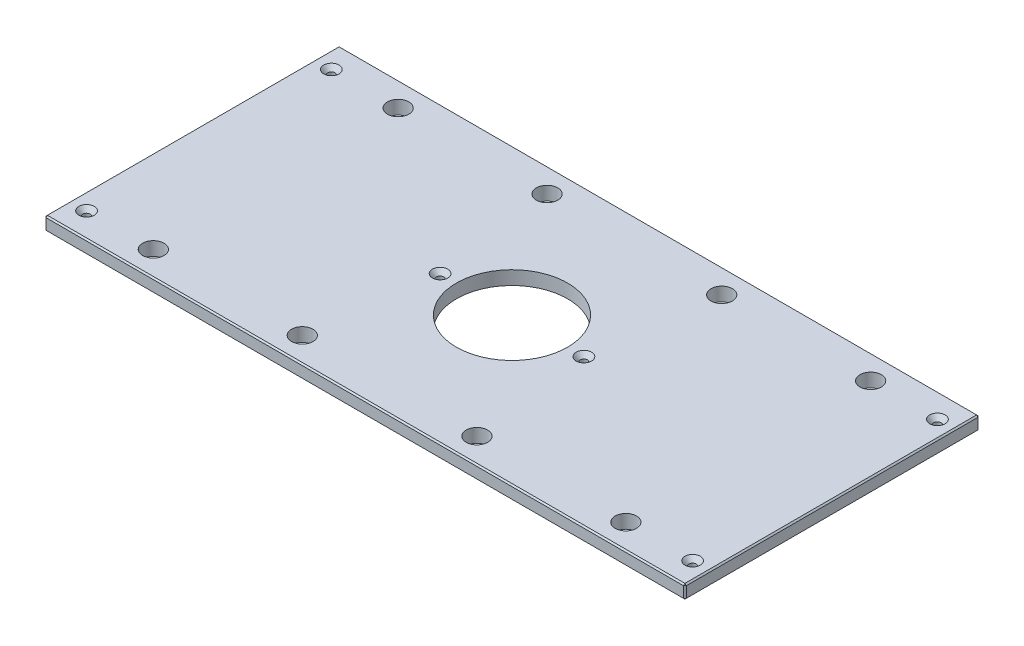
ISO-10303-21;
HEADER;
FILE_DESCRIPTION(('STEP AP214'),'2;1');
FILE_NAME('part.step','',(''),(''),'','','');
FILE_SCHEMA(('AUTOMOTIVE_DESIGN { 1 0 10303 214 1 1 1 1 }'));
ENDSEC;
DATA;
#1=APPLICATION_CONTEXT('core data for automotive mechanical design processes');
#2=APPLICATION_PROTOCOL_DEFINITION('international standard','automotive_design',2000,#1);
#3=PRODUCT_CONTEXT('',#1,'mechanical');
#4=PRODUCT('Part','Part','',(#3));
#5=PRODUCT_RELATED_PRODUCT_CATEGORY('part','',(#4));
#6=PRODUCT_DEFINITION_FORMATION('','',#4);
#7=PRODUCT_DEFINITION_CONTEXT('part definition',#1,'design');
#8=PRODUCT_DEFINITION('design','',#6,#7);
#9=PRODUCT_DEFINITION_SHAPE('','',#8);
#10=(LENGTH_UNIT() NAMED_UNIT(*) SI_UNIT(.MILLI.,.METRE.));
#11=(NAMED_UNIT(*) PLANE_ANGLE_UNIT() SI_UNIT($,.RADIAN.));
#12=(NAMED_UNIT(*) SI_UNIT($,.STERADIAN.) SOLID_ANGLE_UNIT());
#13=UNCERTAINTY_MEASURE_WITH_UNIT(LENGTH_MEASURE(1.E-05),#10,'distance_accuracy_value','');
#14=(GEOMETRIC_REPRESENTATION_CONTEXT(3) GLOBAL_UNCERTAINTY_ASSIGNED_CONTEXT((#13)) GLOBAL_UNIT_ASSIGNED_CONTEXT((#10,
#11,#12)) REPRESENTATION_CONTEXT('',''));
#15=CARTESIAN_POINT('',(0.,0.,0.));
#16=DIRECTION('',(0.,0.,1.));
#17=DIRECTION('',(1.,0.,0.));
#18=AXIS2_PLACEMENT_3D('',#15,#16,#17);
#19=CARTESIAN_POINT('',(-296.8625,12.7,-136.525));
#20=DIRECTION('',(1.,0.,0.));
#21=DIRECTION('',(0.,0.,-1.));
#22=AXIS2_PLACEMENT_3D('',#19,#20,#21);
#23=PLANE('',#22);
#24=DIRECTION('',(0.,0.,-1.));
#25=VECTOR('',#24,1.);
#26=CARTESIAN_POINT('',(-296.8625,11.4299999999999,-136.525));
#27=LINE('',#26,#25);
#28=CARTESIAN_POINT('',(-296.8625,11.4299999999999,135.255));
#29=VERTEX_POINT('',#28);
#30=CARTESIAN_POINT('',(-296.8625,11.4299999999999,-135.255));
#31=VERTEX_POINT('',#30);
#32=EDGE_CURVE('E135',#29,#31,#27,.T.);
#33=ORIENTED_EDGE('',*,*,#32,.T.);
#34=DIRECTION('',(0.,-1.,0.));
#35=VECTOR('',#34,1.);
#36=CARTESIAN_POINT('',(-296.8625,12.7,-135.255));
#37=LINE('',#36,#35);
#38=CARTESIAN_POINT('',(-296.8625,1.27000000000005,-135.255));
#39=VERTEX_POINT('',#38);
#40=EDGE_CURVE('E131',#31,#39,#37,.T.);
#41=ORIENTED_EDGE('',*,*,#40,.T.);
#42=DIRECTION('',(0.,0.,1.));
#43=VECTOR('',#42,1.);
#44=CARTESIAN_POINT('',(-296.8625,1.27000000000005,-136.525));
#45=LINE('',#44,#43);
#46=CARTESIAN_POINT('',(-296.8625,1.27000000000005,135.255));
#47=VERTEX_POINT('',#46);
#48=EDGE_CURVE('E126',#39,#47,#45,.T.);
#49=ORIENTED_EDGE('',*,*,#48,.T.);
#50=DIRECTION('',(0.,1.,0.));
#51=VECTOR('',#50,1.);
#52=CARTESIAN_POINT('',(-296.8625,12.7,135.255));
#53=LINE('',#52,#51);
#54=EDGE_CURVE('E128',#47,#29,#53,.T.);
#55=ORIENTED_EDGE('',*,*,#54,.T.);
#56=EDGE_LOOP('',(#33,#41,#49,#55));
#57=FACE_BOUND('',#56,.T.);
#58=ADVANCED_FACE('F35',(#57),#23,.F.);
#59=CARTESIAN_POINT('',(-296.8625,12.7,136.525));
#60=DIRECTION('',(0.,0.,-1.));
#61=DIRECTION('',(-1.,0.,0.));
#62=AXIS2_PLACEMENT_3D('',#59,#60,#61);
#63=PLANE('',#62);
#64=DIRECTION('',(1.,0.,0.));
#65=VECTOR('',#64,1.);
#66=CARTESIAN_POINT('',(-296.8625,1.27000000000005,136.525));
#67=LINE('',#66,#65);
#68=CARTESIAN_POINT('',(-295.5925,1.27000000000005,136.525));
#69=VERTEX_POINT('',#68);
#70=CARTESIAN_POINT('',(295.5925,1.27000000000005,136.525));
#71=VERTEX_POINT('',#70);
#72=EDGE_CURVE('E58',#69,#71,#67,.T.);
#73=ORIENTED_EDGE('',*,*,#72,.T.);
#74=DIRECTION('',(0.,1.,0.));
#75=VECTOR('',#74,1.);
#76=CARTESIAN_POINT('',(295.5925,12.7,136.525));
#77=LINE('',#76,#75);
#78=CARTESIAN_POINT('',(295.5925,11.4299999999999,136.525));
#79=VERTEX_POINT('',#78);
#80=EDGE_CURVE('E11',#71,#79,#77,.T.);
#81=ORIENTED_EDGE('',*,*,#80,.T.);
#82=DIRECTION('',(-1.,0.,0.));
#83=VECTOR('',#82,1.);
#84=CARTESIAN_POINT('',(-296.8625,11.4299999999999,136.525));
#85=LINE('',#84,#83);
#86=CARTESIAN_POINT('',(-295.5925,11.4299999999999,136.525));
#87=VERTEX_POINT('',#86);
#88=EDGE_CURVE('E44',#79,#87,#85,.T.);
#89=ORIENTED_EDGE('',*,*,#88,.T.);
#90=DIRECTION('',(0.,-1.,0.));
#91=VECTOR('',#90,1.);
#92=CARTESIAN_POINT('',(-295.5925,12.7,136.525));
#93=LINE('',#92,#91);
#94=EDGE_CURVE('E303',#87,#69,#93,.T.);
#95=ORIENTED_EDGE('',*,*,#94,.T.);
#96=EDGE_LOOP('',(#73,#81,#89,#95));
#97=FACE_BOUND('',#96,.T.);
#98=ADVANCED_FACE('F372',(#97),#63,.F.);
#99=CARTESIAN_POINT('',(296.8625,12.7,-136.525));
#100=DIRECTION('',(-1.,0.,0.));
#101=DIRECTION('',(0.,0.,1.));
#102=AXIS2_PLACEMENT_3D('',#99,#100,#101);
#103=PLANE('',#102);
#104=DIRECTION('',(0.,0.,-1.));
#105=VECTOR('',#104,1.);
#106=CARTESIAN_POINT('',(296.8625,1.27000000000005,-136.525));
#107=LINE('',#106,#105);
#108=CARTESIAN_POINT('',(296.8625,1.27000000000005,135.255));
#109=VERTEX_POINT('',#108);
#110=CARTESIAN_POINT('',(296.8625,1.27000000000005,-135.255));
#111=VERTEX_POINT('',#110);
#112=EDGE_CURVE('E298',#109,#111,#107,.T.);
#113=ORIENTED_EDGE('',*,*,#112,.T.);
#114=DIRECTION('',(0.,1.,0.));
#115=VECTOR('',#114,1.);
#116=CARTESIAN_POINT('',(296.8625,12.7,-135.255));
#117=LINE('',#116,#115);
#118=CARTESIAN_POINT('',(296.8625,11.4299999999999,-135.255));
#119=VERTEX_POINT('',#118);
#120=EDGE_CURVE('E300',#111,#119,#117,.T.);
#121=ORIENTED_EDGE('',*,*,#120,.T.);
#122=DIRECTION('',(0.,0.,1.));
#123=VECTOR('',#122,1.);
#124=CARTESIAN_POINT('',(296.8625,11.4299999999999,136.525));
#125=LINE('',#124,#123);
#126=CARTESIAN_POINT('',(296.8625,11.4299999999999,135.255));
#127=VERTEX_POINT('',#126);
#128=EDGE_CURVE('E296',#119,#127,#125,.T.);
#129=ORIENTED_EDGE('',*,*,#128,.T.);
#130=DIRECTION('',(0.,-1.,0.));
#131=VECTOR('',#130,1.);
#132=CARTESIAN_POINT('',(296.8625,12.7,135.255));
#133=LINE('',#132,#131);
#134=EDGE_CURVE('E294',#127,#109,#133,.T.);
#135=ORIENTED_EDGE('',*,*,#134,.T.);
#136=EDGE_LOOP('',(#113,#121,#129,#135));
#137=FACE_BOUND('',#136,.T.);
#138=ADVANCED_FACE('F359',(#137),#103,.F.);
#139=CARTESIAN_POINT('',(-296.8625,12.7,-136.525));
#140=DIRECTION('',(0.,0.,1.));
#141=DIRECTION('',(1.,0.,0.));
#142=AXIS2_PLACEMENT_3D('',#139,#140,#141);
#143=PLANE('',#142);
#144=DIRECTION('',(-1.,0.,0.));
#145=VECTOR('',#144,1.);
#146=CARTESIAN_POINT('',(-296.8625,1.27000000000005,-136.525));
#147=LINE('',#146,#145);
#148=CARTESIAN_POINT('',(295.5925,1.27000000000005,-136.525));
#149=VERTEX_POINT('',#148);
#150=CARTESIAN_POINT('',(-295.5925,1.27000000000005,-136.525));
#151=VERTEX_POINT('',#150);
#152=EDGE_CURVE('E270',#149,#151,#147,.T.);
#153=ORIENTED_EDGE('',*,*,#152,.T.);
#154=DIRECTION('',(0.,1.,0.));
#155=VECTOR('',#154,1.);
#156=CARTESIAN_POINT('',(-295.5925,12.7,-136.525));
#157=LINE('',#156,#155);
#158=CARTESIAN_POINT('',(-295.5925,11.4299999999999,-136.525));
#159=VERTEX_POINT('',#158);
#160=EDGE_CURVE('E274',#151,#159,#157,.T.);
#161=ORIENTED_EDGE('',*,*,#160,.T.);
#162=DIRECTION('',(1.,0.,0.));
#163=VECTOR('',#162,1.);
#164=CARTESIAN_POINT('',(296.8625,11.4299999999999,-136.525));
#165=LINE('',#164,#163);
#166=CARTESIAN_POINT('',(295.5925,11.4299999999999,-136.525));
#167=VERTEX_POINT('',#166);
#168=EDGE_CURVE('E272',#159,#167,#165,.T.);
#169=ORIENTED_EDGE('',*,*,#168,.T.);
#170=DIRECTION('',(0.,-1.,0.));
#171=VECTOR('',#170,1.);
#172=CARTESIAN_POINT('',(295.5925,12.7,-136.525));
#173=LINE('',#172,#171);
#174=EDGE_CURVE('E268',#167,#149,#173,.T.);
#175=ORIENTED_EDGE('',*,*,#174,.T.);
#176=EDGE_LOOP('',(#153,#161,#169,#175));
#177=FACE_BOUND('',#176,.T.);
#178=ADVANCED_FACE('F333',(#177),#143,.F.);
#179=CARTESIAN_POINT('',(0.,12.7,0.));
#180=DIRECTION('',(0.,1.,0.));
#181=DIRECTION('',(0.,0.,1.));
#182=AXIS2_PLACEMENT_3D('',#179,#180,#181);
#183=PLANE('',#182);
#184=CARTESIAN_POINT('',(280.9875,12.7,-113.50498));
#185=DIRECTION('',(0.,1.,0.));
#186=DIRECTION('',(0.,0.,1.));
#187=AXIS2_PLACEMENT_3D('',#184,#185,#186);
#188=CIRCLE('',#187,7.13740000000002);
#189=CARTESIAN_POINT('',(280.9875,12.7,-106.36758));
#190=VERTEX_POINT('',#189);
#191=EDGE_CURVE('E816',#190,#190,#188,.T.);
#192=ORIENTED_EDGE('',*,*,#191,.F.);
#193=EDGE_LOOP('',(#192));
#194=FACE_BOUND('',#193,.T.);
#195=CARTESIAN_POINT('',(280.9875,12.7,113.50498));
#196=DIRECTION('',(0.,1.,0.));
#197=DIRECTION('',(0.,0.,1.));
#198=AXIS2_PLACEMENT_3D('',#195,#196,#197);
#199=CIRCLE('',#198,7.13740000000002);
#200=CARTESIAN_POINT('',(280.9875,12.7,120.64238));
#201=VERTEX_POINT('',#200);
#202=EDGE_CURVE('E820',#201,#201,#199,.T.);
#203=ORIENTED_EDGE('',*,*,#202,.F.);
#204=EDGE_LOOP('',(#203));
#205=FACE_BOUND('',#204,.T.);
#206=CARTESIAN_POINT('',(-280.9875,12.7,113.50498));
#207=DIRECTION('',(0.,1.,0.));
#208=DIRECTION('',(0.,0.,1.));
#209=AXIS2_PLACEMENT_3D('',#206,#207,#208);
#210=CIRCLE('',#209,7.13740000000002);
#211=CARTESIAN_POINT('',(-280.9875,12.7,120.64238));
#212=VERTEX_POINT('',#211);
#213=EDGE_CURVE('E824',#212,#212,#210,.T.);
#214=ORIENTED_EDGE('',*,*,#213,.F.);
#215=EDGE_LOOP('',(#214));
#216=FACE_BOUND('',#215,.T.);
#217=CARTESIAN_POINT('',(-66.675,12.7,0.));
#218=DIRECTION('',(0.,1.,0.));
#219=DIRECTION('',(0.,0.,1.));
#220=AXIS2_PLACEMENT_3D('',#217,#218,#219);
#221=CIRCLE('',#220,7.1374);
#222=CARTESIAN_POINT('',(-66.675,12.7,7.1374));
#223=VERTEX_POINT('',#222);
#224=EDGE_CURVE('E828',#223,#223,#221,.T.);
#225=ORIENTED_EDGE('',*,*,#224,.F.);
#226=EDGE_LOOP('',(#225));
#227=FACE_BOUND('',#226,.T.);
#228=CARTESIAN_POINT('',(66.675,12.7,0.));
#229=DIRECTION('',(0.,1.,0.));
#230=DIRECTION('',(0.,0.,1.));
#231=AXIS2_PLACEMENT_3D('',#228,#229,#230);
#232=CIRCLE('',#231,7.1374);
#233=CARTESIAN_POINT('',(66.675,12.7,7.1374));
#234=VERTEX_POINT('',#233);
#235=EDGE_CURVE('E832',#234,#234,#232,.T.);
#236=ORIENTED_EDGE('',*,*,#235,.F.);
#237=EDGE_LOOP('',(#236));
#238=FACE_BOUND('',#237,.T.);
#239=CARTESIAN_POINT('',(-280.9875,12.7,-113.50498));
#240=DIRECTION('',(0.,1.,0.));
#241=DIRECTION('',(0.,0.,1.));
#242=AXIS2_PLACEMENT_3D('',#239,#240,#241);
#243=CIRCLE('',#242,7.13740000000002);
#244=CARTESIAN_POINT('',(-280.9875,12.7,-106.36758));
#245=VERTEX_POINT('',#244);
#246=EDGE_CURVE('E835',#245,#245,#243,.T.);
#247=ORIENTED_EDGE('',*,*,#246,.F.);
#248=EDGE_LOOP('',(#247));
#249=FACE_BOUND('',#248,.T.);
#250=DIRECTION('',(0.,0.,-1.));
#251=VECTOR('',#250,1.);
#252=CARTESIAN_POINT('',(295.5925,12.7,-136.525));
#253=LINE('',#252,#251);
#254=CARTESIAN_POINT('',(295.5925,12.7,135.255));
#255=VERTEX_POINT('',#254);
#256=CARTESIAN_POINT('',(295.5925,12.7,-135.255));
#257=VERTEX_POINT('',#256);
#258=EDGE_CURVE('E281',#255,#257,#253,.T.);
#259=ORIENTED_EDGE('',*,*,#258,.T.);
#260=DIRECTION('',(-1.,0.,0.));
#261=VECTOR('',#260,1.);
#262=CARTESIAN_POINT('',(-296.8625,12.7,-135.255));
#263=LINE('',#262,#261);
#264=CARTESIAN_POINT('',(-295.5925,12.7,-135.255));
#265=VERTEX_POINT('',#264);
#266=EDGE_CURVE('E283',#257,#265,#263,.T.);
#267=ORIENTED_EDGE('',*,*,#266,.T.);
#268=DIRECTION('',(0.,0.,1.));
#269=VECTOR('',#268,1.);
#270=CARTESIAN_POINT('',(-295.5925,12.7,136.525));
#271=LINE('',#270,#269);
#272=CARTESIAN_POINT('',(-295.5925,12.7,135.255));
#273=VERTEX_POINT('',#272);
#274=EDGE_CURVE('E279',#265,#273,#271,.T.);
#275=ORIENTED_EDGE('',*,*,#274,.T.);
#276=DIRECTION('',(1.,0.,0.));
#277=VECTOR('',#276,1.);
#278=CARTESIAN_POINT('',(296.8625,12.7,135.255));
#279=LINE('',#278,#277);
#280=EDGE_CURVE('E277',#273,#255,#279,.T.);
#281=ORIENTED_EDGE('',*,*,#280,.T.);
#282=EDGE_LOOP('',(#259,#267,#275,#281));
#283=FACE_BOUND('',#282,.T.);
#284=CARTESIAN_POINT('',(219.075,12.7,-113.50498));
#285=DIRECTION('',(0.,1.,0.));
#286=DIRECTION('',(0.,0.,1.));
#287=AXIS2_PLACEMENT_3D('',#284,#285,#286);
#288=CIRCLE('',#287,9.921875);
#289=CARTESIAN_POINT('',(219.075,12.7,-103.583105));
#290=VERTEX_POINT('',#289);
#291=EDGE_CURVE('E204',#290,#290,#288,.T.);
#292=ORIENTED_EDGE('',*,*,#291,.F.);
#293=EDGE_LOOP('',(#292));
#294=FACE_BOUND('',#293,.T.);
#295=CARTESIAN_POINT('',(-219.075,12.7,-113.50498));
#296=DIRECTION('',(0.,1.,0.));
#297=DIRECTION('',(0.,0.,1.));
#298=AXIS2_PLACEMENT_3D('',#295,#296,#297);
#299=CIRCLE('',#298,9.921875);
#300=CARTESIAN_POINT('',(-219.075,12.7,-103.583105));
#301=VERTEX_POINT('',#300);
#302=EDGE_CURVE('E214',#301,#301,#299,.T.);
#303=ORIENTED_EDGE('',*,*,#302,.F.);
#304=EDGE_LOOP('',(#303));
#305=FACE_BOUND('',#304,.T.);
#306=CARTESIAN_POINT('',(219.075,12.7,113.50498));
#307=DIRECTION('',(0.,1.,0.));
#308=DIRECTION('',(0.,0.,1.));
#309=AXIS2_PLACEMENT_3D('',#306,#307,#308);
#310=CIRCLE('',#309,9.921875);
#311=CARTESIAN_POINT('',(219.075,12.7,123.426855));
#312=VERTEX_POINT('',#311);
#313=EDGE_CURVE('E225',#312,#312,#310,.T.);
#314=ORIENTED_EDGE('',*,*,#313,.F.);
#315=EDGE_LOOP('',(#314));
#316=FACE_BOUND('',#315,.T.);
#317=CARTESIAN_POINT('',(-219.075,12.7,113.50498));
#318=DIRECTION('',(0.,1.,0.));
#319=DIRECTION('',(0.,0.,1.));
#320=AXIS2_PLACEMENT_3D('',#317,#318,#319);
#321=CIRCLE('',#320,9.921875);
#322=CARTESIAN_POINT('',(-219.075,12.7,123.426855));
#323=VERTEX_POINT('',#322);
#324=EDGE_CURVE('E231',#323,#323,#321,.T.);
#325=ORIENTED_EDGE('',*,*,#324,.F.);
#326=EDGE_LOOP('',(#325));
#327=FACE_BOUND('',#326,.T.);
#328=CARTESIAN_POINT('',(-80.9625,12.7,-113.50498));
#329=DIRECTION('',(0.,1.,0.));
#330=DIRECTION('',(0.,0.,1.));
#331=AXIS2_PLACEMENT_3D('',#328,#329,#330);
#332=CIRCLE('',#331,9.921875);
#333=CARTESIAN_POINT('',(-80.9625,12.7,-103.583105));
#334=VERTEX_POINT('',#333);
#335=EDGE_CURVE('E237',#334,#334,#332,.T.);
#336=ORIENTED_EDGE('',*,*,#335,.F.);
#337=EDGE_LOOP('',(#336));
#338=FACE_BOUND('',#337,.T.);
#339=CARTESIAN_POINT('',(80.9625,12.7,-113.50498));
#340=DIRECTION('',(0.,1.,0.));
#341=DIRECTION('',(0.,0.,1.));
#342=AXIS2_PLACEMENT_3D('',#339,#340,#341);
#343=CIRCLE('',#342,9.921875);
#344=CARTESIAN_POINT('',(80.9625,12.7,-103.583105));
#345=VERTEX_POINT('',#344);
#346=EDGE_CURVE('E243',#345,#345,#343,.T.);
#347=ORIENTED_EDGE('',*,*,#346,.F.);
#348=EDGE_LOOP('',(#347));
#349=FACE_BOUND('',#348,.T.);
#350=CARTESIAN_POINT('',(80.9625,12.7,113.50498));
#351=DIRECTION('',(0.,1.,0.));
#352=DIRECTION('',(0.,0.,1.));
#353=AXIS2_PLACEMENT_3D('',#350,#351,#352);
#354=CIRCLE('',#353,9.921875);
#355=CARTESIAN_POINT('',(80.9625,12.7,123.426855));
#356=VERTEX_POINT('',#355);
#357=EDGE_CURVE('E249',#356,#356,#354,.T.);
#358=ORIENTED_EDGE('',*,*,#357,.F.);
#359=EDGE_LOOP('',(#358));
#360=FACE_BOUND('',#359,.T.);
#361=CARTESIAN_POINT('',(-80.9625,12.7,113.50498));
#362=DIRECTION('',(0.,1.,0.));
#363=DIRECTION('',(0.,0.,1.));
#364=AXIS2_PLACEMENT_3D('',#361,#362,#363);
#365=CIRCLE('',#364,9.921875);
#366=CARTESIAN_POINT('',(-80.9625,12.7,123.426855));
#367=VERTEX_POINT('',#366);
#368=EDGE_CURVE('E255',#367,#367,#365,.T.);
#369=ORIENTED_EDGE('',*,*,#368,.F.);
#370=EDGE_LOOP('',(#369));
#371=FACE_BOUND('',#370,.T.);
#372=CARTESIAN_POINT('',(0.,12.7,0.));
#373=DIRECTION('',(0.,1.,0.));
#374=DIRECTION('',(0.,0.,1.));
#375=AXIS2_PLACEMENT_3D('',#372,#373,#374);
#376=CIRCLE('',#375,51.562);
#377=CARTESIAN_POINT('',(0.,12.7,51.562));
#378=VERTEX_POINT('',#377);
#379=EDGE_CURVE('E261',#378,#378,#376,.T.);
#380=ORIENTED_EDGE('',*,*,#379,.F.);
#381=EDGE_LOOP('',(#380));
#382=FACE_BOUND('',#381,.T.);
#383=ADVANCED_FACE('F381',(#194,#205,#216,#227,#238,#249,#283,#294,#305,#316,#327,#338,#349,
#360,#371,#382),#183,.T.);
#384=CARTESIAN_POINT('',(0.,0.,0.));
#385=DIRECTION('',(0.,1.,0.));
#386=DIRECTION('',(0.,0.,1.));
#387=AXIS2_PLACEMENT_3D('',#384,#385,#386);
#388=PLANE('',#387);
#389=CARTESIAN_POINT('',(280.9875,0.,-113.50498));
#390=DIRECTION('',(0.,1.,0.));
#391=DIRECTION('',(0.,0.,1.));
#392=AXIS2_PLACEMENT_3D('',#389,#390,#391);
#393=CIRCLE('',#392,3.3782);
#394=CARTESIAN_POINT('',(280.9875,0.,-110.12678));
#395=VERTEX_POINT('',#394);
#396=EDGE_CURVE('E869',#395,#395,#393,.T.);
#397=ORIENTED_EDGE('',*,*,#396,.T.);
#398=EDGE_LOOP('',(#397));
#399=FACE_BOUND('',#398,.T.);
#400=CARTESIAN_POINT('',(280.9875,0.,113.50498));
#401=DIRECTION('',(0.,1.,0.));
#402=DIRECTION('',(0.,0.,1.));
#403=AXIS2_PLACEMENT_3D('',#400,#401,#402);
#404=CIRCLE('',#403,3.3782);
#405=CARTESIAN_POINT('',(280.9875,0.,116.88318));
#406=VERTEX_POINT('',#405);
#407=EDGE_CURVE('E862',#406,#406,#404,.T.);
#408=ORIENTED_EDGE('',*,*,#407,.T.);
#409=EDGE_LOOP('',(#408));
#410=FACE_BOUND('',#409,.T.);
#411=CARTESIAN_POINT('',(-280.9875,0.,113.50498));
#412=DIRECTION('',(0.,1.,0.));
#413=DIRECTION('',(0.,0.,1.));
#414=AXIS2_PLACEMENT_3D('',#411,#412,#413);
#415=CIRCLE('',#414,3.3782);
#416=CARTESIAN_POINT('',(-280.9875,0.,116.88318));
#417=VERTEX_POINT('',#416);
#418=EDGE_CURVE('E855',#417,#417,#415,.T.);
#419=ORIENTED_EDGE('',*,*,#418,.T.);
#420=EDGE_LOOP('',(#419));
#421=FACE_BOUND('',#420,.T.);
#422=CARTESIAN_POINT('',(-66.675,0.,0.));
#423=DIRECTION('',(0.,1.,0.));
#424=DIRECTION('',(0.,0.,1.));
#425=AXIS2_PLACEMENT_3D('',#422,#423,#424);
#426=CIRCLE('',#425,3.3782);
#427=CARTESIAN_POINT('',(-66.675,0.,3.3782));
#428=VERTEX_POINT('',#427);
#429=EDGE_CURVE('E848',#428,#428,#426,.T.);
#430=ORIENTED_EDGE('',*,*,#429,.T.);
#431=EDGE_LOOP('',(#430));
#432=FACE_BOUND('',#431,.T.);
#433=CARTESIAN_POINT('',(66.675,0.,0.));
#434=DIRECTION('',(0.,1.,0.));
#435=DIRECTION('',(0.,0.,1.));
#436=AXIS2_PLACEMENT_3D('',#433,#434,#435);
#437=CIRCLE('',#436,3.3782);
#438=CARTESIAN_POINT('',(66.675,0.,3.3782));
#439=VERTEX_POINT('',#438);
#440=EDGE_CURVE('E838',#439,#439,#437,.T.);
#441=ORIENTED_EDGE('',*,*,#440,.T.);
#442=EDGE_LOOP('',(#441));
#443=FACE_BOUND('',#442,.T.);
#444=CARTESIAN_POINT('',(-280.9875,0.,-113.50498));
#445=DIRECTION('',(0.,1.,0.));
#446=DIRECTION('',(0.,0.,1.));
#447=AXIS2_PLACEMENT_3D('',#444,#445,#446);
#448=CIRCLE('',#447,3.3782);
#449=CARTESIAN_POINT('',(-280.9875,0.,-110.12678));
#450=VERTEX_POINT('',#449);
#451=EDGE_CURVE('E217',#450,#450,#448,.T.);
#452=ORIENTED_EDGE('',*,*,#451,.T.);
#453=EDGE_LOOP('',(#452));
#454=FACE_BOUND('',#453,.T.);
#455=DIRECTION('',(0.,0.,-1.));
#456=VECTOR('',#455,1.);
#457=CARTESIAN_POINT('',(-295.5925,0.,0.));
#458=LINE('',#457,#456);
#459=CARTESIAN_POINT('',(-295.5925,0.,135.255));
#460=VERTEX_POINT('',#459);
#461=CARTESIAN_POINT('',(-295.5925,0.,-135.255));
#462=VERTEX_POINT('',#461);
#463=EDGE_CURVE('E158',#460,#462,#458,.T.);
#464=ORIENTED_EDGE('',*,*,#463,.T.);
#465=DIRECTION('',(1.,0.,0.));
#466=VECTOR('',#465,1.);
#467=CARTESIAN_POINT('',(0.,0.,-135.255));
#468=LINE('',#467,#466);
#469=CARTESIAN_POINT('',(295.5925,0.,-135.255));
#470=VERTEX_POINT('',#469);
#471=EDGE_CURVE('E291',#462,#470,#468,.T.);
#472=ORIENTED_EDGE('',*,*,#471,.T.);
#473=DIRECTION('',(0.,0.,1.));
#474=VECTOR('',#473,1.);
#475=CARTESIAN_POINT('',(295.5925,0.,0.));
#476=LINE('',#475,#474);
#477=CARTESIAN_POINT('',(295.5925,0.,135.255));
#478=VERTEX_POINT('',#477);
#479=EDGE_CURVE('E289',#470,#478,#476,.T.);
#480=ORIENTED_EDGE('',*,*,#479,.T.);
#481=DIRECTION('',(-1.,0.,0.));
#482=VECTOR('',#481,1.);
#483=CARTESIAN_POINT('',(0.,0.,135.255));
#484=LINE('',#483,#482);
#485=EDGE_CURVE('E286',#478,#460,#484,.T.);
#486=ORIENTED_EDGE('',*,*,#485,.T.);
#487=EDGE_LOOP('',(#464,#472,#480,#486));
#488=FACE_BOUND('',#487,.T.);
#489=CARTESIAN_POINT('',(219.075,0.,-113.50498));
#490=DIRECTION('',(0.,1.,0.));
#491=DIRECTION('',(0.,0.,1.));
#492=AXIS2_PLACEMENT_3D('',#489,#490,#491);
#493=CIRCLE('',#492,9.921875);
#494=CARTESIAN_POINT('',(219.075,0.,-103.583105));
#495=VERTEX_POINT('',#494);
#496=EDGE_CURVE('E209',#495,#495,#493,.T.);
#497=ORIENTED_EDGE('',*,*,#496,.T.);
#498=EDGE_LOOP('',(#497));
#499=FACE_BOUND('',#498,.T.);
#500=CARTESIAN_POINT('',(-219.075,0.,-113.50498));
#501=DIRECTION('',(0.,1.,0.));
#502=DIRECTION('',(0.,0.,1.));
#503=AXIS2_PLACEMENT_3D('',#500,#501,#502);
#504=CIRCLE('',#503,9.921875);
#505=CARTESIAN_POINT('',(-219.075,0.,-103.583105));
#506=VERTEX_POINT('',#505);
#507=EDGE_CURVE('E222',#506,#506,#504,.T.);
#508=ORIENTED_EDGE('',*,*,#507,.T.);
#509=EDGE_LOOP('',(#508));
#510=FACE_BOUND('',#509,.T.);
#511=CARTESIAN_POINT('',(219.075,0.,113.50498));
#512=DIRECTION('',(0.,1.,0.));
#513=DIRECTION('',(0.,0.,1.));
#514=AXIS2_PLACEMENT_3D('',#511,#512,#513);
#515=CIRCLE('',#514,9.921875);
#516=CARTESIAN_POINT('',(219.075,0.,123.426855));
#517=VERTEX_POINT('',#516);
#518=EDGE_CURVE('E228',#517,#517,#515,.T.);
#519=ORIENTED_EDGE('',*,*,#518,.T.);
#520=EDGE_LOOP('',(#519));
#521=FACE_BOUND('',#520,.T.);
#522=CARTESIAN_POINT('',(-219.075,0.,113.50498));
#523=DIRECTION('',(0.,1.,0.));
#524=DIRECTION('',(0.,0.,1.));
#525=AXIS2_PLACEMENT_3D('',#522,#523,#524);
#526=CIRCLE('',#525,9.921875);
#527=CARTESIAN_POINT('',(-219.075,0.,123.426855));
#528=VERTEX_POINT('',#527);
#529=EDGE_CURVE('E234',#528,#528,#526,.T.);
#530=ORIENTED_EDGE('',*,*,#529,.T.);
#531=EDGE_LOOP('',(#530));
#532=FACE_BOUND('',#531,.T.);
#533=CARTESIAN_POINT('',(-80.9625,0.,-113.50498));
#534=DIRECTION('',(0.,1.,0.));
#535=DIRECTION('',(0.,0.,1.));
#536=AXIS2_PLACEMENT_3D('',#533,#534,#535);
#537=CIRCLE('',#536,9.921875);
#538=CARTESIAN_POINT('',(-80.9625,0.,-103.583105));
#539=VERTEX_POINT('',#538);
#540=EDGE_CURVE('E240',#539,#539,#537,.T.);
#541=ORIENTED_EDGE('',*,*,#540,.T.);
#542=EDGE_LOOP('',(#541));
#543=FACE_BOUND('',#542,.T.);
#544=CARTESIAN_POINT('',(80.9625,0.,-113.50498));
#545=DIRECTION('',(0.,1.,0.));
#546=DIRECTION('',(0.,0.,1.));
#547=AXIS2_PLACEMENT_3D('',#544,#545,#546);
#548=CIRCLE('',#547,9.921875);
#549=CARTESIAN_POINT('',(80.9625,0.,-103.583105));
#550=VERTEX_POINT('',#549);
#551=EDGE_CURVE('E246',#550,#550,#548,.T.);
#552=ORIENTED_EDGE('',*,*,#551,.T.);
#553=EDGE_LOOP('',(#552));
#554=FACE_BOUND('',#553,.T.);
#555=CARTESIAN_POINT('',(80.9625,0.,113.50498));
#556=DIRECTION('',(0.,1.,0.));
#557=DIRECTION('',(0.,0.,1.));
#558=AXIS2_PLACEMENT_3D('',#555,#556,#557);
#559=CIRCLE('',#558,9.921875);
#560=CARTESIAN_POINT('',(80.9625,0.,123.426855));
#561=VERTEX_POINT('',#560);
#562=EDGE_CURVE('E252',#561,#561,#559,.T.);
#563=ORIENTED_EDGE('',*,*,#562,.T.);
#564=EDGE_LOOP('',(#563));
#565=FACE_BOUND('',#564,.T.);
#566=CARTESIAN_POINT('',(-80.9625,0.,113.50498));
#567=DIRECTION('',(0.,1.,0.));
#568=DIRECTION('',(0.,0.,1.));
#569=AXIS2_PLACEMENT_3D('',#566,#567,#568);
#570=CIRCLE('',#569,9.921875);
#571=CARTESIAN_POINT('',(-80.9625,0.,123.426855));
#572=VERTEX_POINT('',#571);
#573=EDGE_CURVE('E258',#572,#572,#570,.T.);
#574=ORIENTED_EDGE('',*,*,#573,.T.);
#575=EDGE_LOOP('',(#574));
#576=FACE_BOUND('',#575,.T.);
#577=CARTESIAN_POINT('',(0.,0.,0.));
#578=DIRECTION('',(0.,1.,0.));
#579=DIRECTION('',(0.,0.,1.));
#580=AXIS2_PLACEMENT_3D('',#577,#578,#579);
#581=CIRCLE('',#580,51.562);
#582=CARTESIAN_POINT('',(0.,0.,51.562));
#583=VERTEX_POINT('',#582);
#584=EDGE_CURVE('E147',#583,#583,#581,.T.);
#585=ORIENTED_EDGE('',*,*,#584,.T.);
#586=EDGE_LOOP('',(#585));
#587=FACE_BOUND('',#586,.T.);
#588=ADVANCED_FACE('F346',(#399,#410,#421,#432,#443,#454,#488,#499,#510,#521,#532,#543,#554,
#565,#576,#587),#388,.F.);
#589=CARTESIAN_POINT('',(0.,0.,0.));
#590=DIRECTION('',(0.,1.,0.));
#591=DIRECTION('',(0.,0.,1.));
#592=AXIS2_PLACEMENT_3D('',#589,#590,#591);
#593=CYLINDRICAL_SURFACE('',#592,51.562);
#594=ORIENTED_EDGE('',*,*,#584,.F.);
#595=EDGE_LOOP('',(#594));
#596=FACE_BOUND('',#595,.T.);
#597=ORIENTED_EDGE('',*,*,#379,.T.);
#598=EDGE_LOOP('',(#597));
#599=FACE_BOUND('',#598,.T.);
#600=ADVANCED_FACE('F751',(#596,#599),#593,.F.);
#601=CARTESIAN_POINT('',(-80.9625,12.7,113.50498));
#602=DIRECTION('',(0.,1.,0.));
#603=DIRECTION('',(0.,0.,1.));
#604=AXIS2_PLACEMENT_3D('',#601,#602,#603);
#605=CYLINDRICAL_SURFACE('',#604,9.921875);
#606=ORIENTED_EDGE('',*,*,#573,.F.);
#607=EDGE_LOOP('',(#606));
#608=FACE_BOUND('',#607,.T.);
#609=ORIENTED_EDGE('',*,*,#368,.T.);
#610=EDGE_LOOP('',(#609));
#611=FACE_BOUND('',#610,.T.);
#612=ADVANCED_FACE('F742',(#608,#611),#605,.F.);
#613=CARTESIAN_POINT('',(80.9625,12.7,113.50498));
#614=DIRECTION('',(0.,1.,0.));
#615=DIRECTION('',(0.,0.,1.));
#616=AXIS2_PLACEMENT_3D('',#613,#614,#615);
#617=CYLINDRICAL_SURFACE('',#616,9.921875);
#618=ORIENTED_EDGE('',*,*,#562,.F.);
#619=EDGE_LOOP('',(#618));
#620=FACE_BOUND('',#619,.T.);
#621=ORIENTED_EDGE('',*,*,#357,.T.);
#622=EDGE_LOOP('',(#621));
#623=FACE_BOUND('',#622,.T.);
#624=ADVANCED_FACE('F733',(#620,#623),#617,.F.);
#625=CARTESIAN_POINT('',(80.9625,12.7,-113.50498));
#626=DIRECTION('',(0.,1.,0.));
#627=DIRECTION('',(0.,0.,1.));
#628=AXIS2_PLACEMENT_3D('',#625,#626,#627);
#629=CYLINDRICAL_SURFACE('',#628,9.921875);
#630=ORIENTED_EDGE('',*,*,#551,.F.);
#631=EDGE_LOOP('',(#630));
#632=FACE_BOUND('',#631,.T.);
#633=ORIENTED_EDGE('',*,*,#346,.T.);
#634=EDGE_LOOP('',(#633));
#635=FACE_BOUND('',#634,.T.);
#636=ADVANCED_FACE('F724',(#632,#635),#629,.F.);
#637=CARTESIAN_POINT('',(-80.9625,12.7,-113.50498));
#638=DIRECTION('',(0.,1.,0.));
#639=DIRECTION('',(0.,0.,1.));
#640=AXIS2_PLACEMENT_3D('',#637,#638,#639);
#641=CYLINDRICAL_SURFACE('',#640,9.921875);
#642=ORIENTED_EDGE('',*,*,#540,.F.);
#643=EDGE_LOOP('',(#642));
#644=FACE_BOUND('',#643,.T.);
#645=ORIENTED_EDGE('',*,*,#335,.T.);
#646=EDGE_LOOP('',(#645));
#647=FACE_BOUND('',#646,.T.);
#648=ADVANCED_FACE('F715',(#644,#647),#641,.F.);
#649=CARTESIAN_POINT('',(-219.075,12.7,113.50498));
#650=DIRECTION('',(0.,1.,0.));
#651=DIRECTION('',(0.,0.,1.));
#652=AXIS2_PLACEMENT_3D('',#649,#650,#651);
#653=CYLINDRICAL_SURFACE('',#652,9.921875);
#654=ORIENTED_EDGE('',*,*,#529,.F.);
#655=EDGE_LOOP('',(#654));
#656=FACE_BOUND('',#655,.T.);
#657=ORIENTED_EDGE('',*,*,#324,.T.);
#658=EDGE_LOOP('',(#657));
#659=FACE_BOUND('',#658,.T.);
#660=ADVANCED_FACE('F706',(#656,#659),#653,.F.);
#661=CARTESIAN_POINT('',(219.075,12.7,113.50498));
#662=DIRECTION('',(0.,1.,0.));
#663=DIRECTION('',(0.,0.,1.));
#664=AXIS2_PLACEMENT_3D('',#661,#662,#663);
#665=CYLINDRICAL_SURFACE('',#664,9.921875);
#666=ORIENTED_EDGE('',*,*,#518,.F.);
#667=EDGE_LOOP('',(#666));
#668=FACE_BOUND('',#667,.T.);
#669=ORIENTED_EDGE('',*,*,#313,.T.);
#670=EDGE_LOOP('',(#669));
#671=FACE_BOUND('',#670,.T.);
#672=ADVANCED_FACE('F697',(#668,#671),#665,.F.);
#673=CARTESIAN_POINT('',(-219.075,12.7,-113.50498));
#674=DIRECTION('',(0.,1.,0.));
#675=DIRECTION('',(0.,0.,1.));
#676=AXIS2_PLACEMENT_3D('',#673,#674,#675);
#677=CYLINDRICAL_SURFACE('',#676,9.921875);
#678=ORIENTED_EDGE('',*,*,#507,.F.);
#679=EDGE_LOOP('',(#678));
#680=FACE_BOUND('',#679,.T.);
#681=ORIENTED_EDGE('',*,*,#302,.T.);
#682=EDGE_LOOP('',(#681));
#683=FACE_BOUND('',#682,.T.);
#684=ADVANCED_FACE('F687',(#680,#683),#677,.F.);
#685=CARTESIAN_POINT('',(219.075,12.7,-113.50498));
#686=DIRECTION('',(0.,1.,0.));
#687=DIRECTION('',(0.,0.,1.));
#688=AXIS2_PLACEMENT_3D('',#685,#686,#687);
#689=CYLINDRICAL_SURFACE('',#688,9.921875);
#690=ORIENTED_EDGE('',*,*,#496,.F.);
#691=EDGE_LOOP('',(#690));
#692=FACE_BOUND('',#691,.T.);
#693=ORIENTED_EDGE('',*,*,#291,.T.);
#694=EDGE_LOOP('',(#693));
#695=FACE_BOUND('',#694,.T.);
#696=ADVANCED_FACE('F390',(#692,#695),#689,.F.);
#697=CARTESIAN_POINT('',(296.8625,12.7,135.255));
#698=DIRECTION('',(-0.707106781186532,0.,-0.707106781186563));
#699=DIRECTION('',(0.,-1.,0.));
#700=AXIS2_PLACEMENT_3D('',#697,#698,#699);
#701=PLANE('',#700);
#702=DIRECTION('',(-0.707106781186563,0.,0.707106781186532));
#703=VECTOR('',#702,1.);
#704=CARTESIAN_POINT('',(296.8625,11.4299999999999,135.255));
#705=LINE('',#704,#703);
#706=EDGE_CURVE('E39',#79,#127,#705,.F.);
#707=ORIENTED_EDGE('',*,*,#706,.F.);
#708=ORIENTED_EDGE('',*,*,#80,.F.);
#709=DIRECTION('',(0.707106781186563,0.,-0.707106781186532));
#710=VECTOR('',#709,1.);
#711=CARTESIAN_POINT('',(296.2275,1.27000000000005,135.89));
#712=LINE('',#711,#710);
#713=EDGE_CURVE('E197',#109,#71,#712,.F.);
#714=ORIENTED_EDGE('',*,*,#713,.F.);
#715=ORIENTED_EDGE('',*,*,#134,.F.);
#716=EDGE_LOOP('',(#707,#708,#714,#715));
#717=FACE_BOUND('',#716,.T.);
#718=ADVANCED_FACE('F37',(#717),#701,.F.);
#719=CARTESIAN_POINT('',(296.8625,11.4299999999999,135.255));
#720=DIRECTION('',(0.577350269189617,0.577350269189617,0.577350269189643));
#721=DIRECTION('',(0.707106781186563,0.,-0.707106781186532));
#722=AXIS2_PLACEMENT_3D('',#719,#720,#721);
#723=PLANE('',#722);
#724=DIRECTION('',(0.,-0.707106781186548,0.707106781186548));
#725=VECTOR('',#724,1.);
#726=CARTESIAN_POINT('',(295.5925,12.065,135.89));
#727=LINE('',#726,#725);
#728=EDGE_CURVE('E193',#79,#255,#727,.F.);
#729=ORIENTED_EDGE('',*,*,#728,.F.);
#730=ORIENTED_EDGE('',*,*,#706,.T.);
#731=DIRECTION('',(-0.707106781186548,0.707106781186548,0.));
#732=VECTOR('',#731,1.);
#733=CARTESIAN_POINT('',(296.8625,11.4299999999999,135.255));
#734=LINE('',#733,#732);
#735=EDGE_CURVE('E195',#255,#127,#734,.F.);
#736=ORIENTED_EDGE('',*,*,#735,.F.);
#737=EDGE_LOOP('',(#729,#730,#736));
#738=FACE_BOUND('',#737,.T.);
#739=ADVANCED_FACE('F383',(#738),#723,.T.);
#740=CARTESIAN_POINT('',(295.5925,0.,135.255));
#741=DIRECTION('',(0.577350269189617,-0.577350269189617,0.577350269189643));
#742=DIRECTION('',(0.707106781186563,0.,-0.707106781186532));
#743=AXIS2_PLACEMENT_3D('',#740,#741,#742);
#744=PLANE('',#743);
#745=DIRECTION('',(-0.707106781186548,-0.707106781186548,0.));
#746=VECTOR('',#745,1.);
#747=CARTESIAN_POINT('',(295.5925,0.,135.255));
#748=LINE('',#747,#746);
#749=EDGE_CURVE('E187',#109,#478,#748,.T.);
#750=ORIENTED_EDGE('',*,*,#749,.F.);
#751=ORIENTED_EDGE('',*,*,#713,.T.);
#752=DIRECTION('',(0.,0.707106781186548,0.707106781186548));
#753=VECTOR('',#752,1.);
#754=CARTESIAN_POINT('',(295.5925,0.,135.255));
#755=LINE('',#754,#753);
#756=EDGE_CURVE('E190',#478,#71,#755,.T.);
#757=ORIENTED_EDGE('',*,*,#756,.F.);
#758=EDGE_LOOP('',(#750,#751,#757));
#759=FACE_BOUND('',#758,.T.);
#760=ADVANCED_FACE('F352',(#759),#744,.T.);
#761=CARTESIAN_POINT('',(295.5925,12.7,0.));
#762=DIRECTION('',(0.707106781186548,0.707106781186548,0.));
#763=DIRECTION('',(0.,0.,1.));
#764=AXIS2_PLACEMENT_3D('',#761,#762,#763);
#765=PLANE('',#764);
#766=ORIENTED_EDGE('',*,*,#735,.T.);
#767=ORIENTED_EDGE('',*,*,#128,.F.);
#768=DIRECTION('',(0.707106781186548,-0.707106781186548,0.));
#769=VECTOR('',#768,1.);
#770=CARTESIAN_POINT('',(296.2275,12.065,-135.255));
#771=LINE('',#770,#769);
#772=EDGE_CURVE('E182',#257,#119,#771,.T.);
#773=ORIENTED_EDGE('',*,*,#772,.F.);
#774=ORIENTED_EDGE('',*,*,#258,.F.);
#775=EDGE_LOOP('',(#766,#767,#773,#774));
#776=FACE_BOUND('',#775,.T.);
#777=ADVANCED_FACE('F369',(#776),#765,.T.);
#778=CARTESIAN_POINT('',(0.,12.7,135.255));
#779=DIRECTION('',(0.,0.707106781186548,0.707106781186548));
#780=DIRECTION('',(-1.,0.,0.));
#781=AXIS2_PLACEMENT_3D('',#778,#779,#780);
#782=PLANE('',#781);
#783=ORIENTED_EDGE('',*,*,#728,.T.);
#784=ORIENTED_EDGE('',*,*,#280,.F.);
#785=DIRECTION('',(0.,0.707106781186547,-0.707106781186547));
#786=VECTOR('',#785,1.);
#787=CARTESIAN_POINT('',(-295.5925,12.7,135.255));
#788=LINE('',#787,#786);
#789=EDGE_CURVE('E179',#87,#273,#788,.T.);
#790=ORIENTED_EDGE('',*,*,#789,.F.);
#791=ORIENTED_EDGE('',*,*,#88,.F.);
#792=EDGE_LOOP('',(#783,#784,#790,#791));
#793=FACE_BOUND('',#792,.T.);
#794=ADVANCED_FACE('F374',(#793),#782,.T.);
#795=CARTESIAN_POINT('',(-295.5925,12.7,136.525));
#796=DIRECTION('',(0.707106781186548,0.,-0.707106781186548));
#797=DIRECTION('',(0.,-1.,0.));
#798=AXIS2_PLACEMENT_3D('',#795,#796,#797);
#799=PLANE('',#798);
#800=DIRECTION('',(0.707106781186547,0.,0.707106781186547));
#801=VECTOR('',#800,1.);
#802=CARTESIAN_POINT('',(-296.8625,1.27000000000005,135.255));
#803=LINE('',#802,#801);
#804=EDGE_CURVE('E142',#69,#47,#803,.F.);
#805=ORIENTED_EDGE('',*,*,#804,.F.);
#806=ORIENTED_EDGE('',*,*,#94,.F.);
#807=DIRECTION('',(-0.707106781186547,0.,-0.707106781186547));
#808=VECTOR('',#807,1.);
#809=CARTESIAN_POINT('',(-296.2275,11.4299999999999,135.89));
#810=LINE('',#809,#808);
#811=EDGE_CURVE('E145',#29,#87,#810,.F.);
#812=ORIENTED_EDGE('',*,*,#811,.F.);
#813=ORIENTED_EDGE('',*,*,#54,.F.);
#814=EDGE_LOOP('',(#805,#806,#812,#813));
#815=FACE_BOUND('',#814,.T.);
#816=ADVANCED_FACE('F140',(#815),#799,.F.);
#817=CARTESIAN_POINT('',(-296.8625,1.27000000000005,136.525));
#818=DIRECTION('',(0.,0.707106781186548,-0.707106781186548));
#819=DIRECTION('',(1.,0.,0.));
#820=AXIS2_PLACEMENT_3D('',#817,#818,#819);
#821=PLANE('',#820);
#822=ORIENTED_EDGE('',*,*,#756,.T.);
#823=ORIENTED_EDGE('',*,*,#72,.F.);
#824=DIRECTION('',(0.,-0.707106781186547,-0.707106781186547));
#825=VECTOR('',#824,1.);
#826=CARTESIAN_POINT('',(-295.5925,0.635000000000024,135.89));
#827=LINE('',#826,#825);
#828=EDGE_CURVE('E155',#460,#69,#827,.F.);
#829=ORIENTED_EDGE('',*,*,#828,.F.);
#830=ORIENTED_EDGE('',*,*,#485,.F.);
#831=EDGE_LOOP('',(#822,#823,#829,#830));
#832=FACE_BOUND('',#831,.T.);
#833=ADVANCED_FACE('F351',(#832),#821,.F.);
#834=CARTESIAN_POINT('',(296.8625,1.27000000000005,-136.525));
#835=DIRECTION('',(-0.707106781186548,0.707106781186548,0.));
#836=DIRECTION('',(0.,0.,-1.));
#837=AXIS2_PLACEMENT_3D('',#834,#835,#836);
#838=PLANE('',#837);
#839=ORIENTED_EDGE('',*,*,#749,.T.);
#840=ORIENTED_EDGE('',*,*,#479,.F.);
#841=DIRECTION('',(0.707106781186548,0.707106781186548,0.));
#842=VECTOR('',#841,1.);
#843=CARTESIAN_POINT('',(295.5925,0.,-135.255));
#844=LINE('',#843,#842);
#845=EDGE_CURVE('E174',#111,#470,#844,.F.);
#846=ORIENTED_EDGE('',*,*,#845,.F.);
#847=ORIENTED_EDGE('',*,*,#112,.F.);
#848=EDGE_LOOP('',(#839,#840,#846,#847));
#849=FACE_BOUND('',#848,.T.);
#850=ADVANCED_FACE('F356',(#849),#838,.F.);
#851=CARTESIAN_POINT('',(295.5925,12.7,-136.525));
#852=DIRECTION('',(-0.707106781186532,0.,0.707106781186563));
#853=DIRECTION('',(0.,-1.,0.));
#854=AXIS2_PLACEMENT_3D('',#851,#852,#853);
#855=PLANE('',#854);
#856=DIRECTION('',(0.707106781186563,0.,0.707106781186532));
#857=VECTOR('',#856,1.);
#858=CARTESIAN_POINT('',(295.5925,11.4299999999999,-136.525));
#859=LINE('',#858,#857);
#860=EDGE_CURVE('E184',#119,#167,#859,.F.);
#861=ORIENTED_EDGE('',*,*,#860,.F.);
#862=ORIENTED_EDGE('',*,*,#120,.F.);
#863=DIRECTION('',(-0.707106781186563,0.,-0.707106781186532));
#864=VECTOR('',#863,1.);
#865=CARTESIAN_POINT('',(296.2275,1.27000000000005,-135.89));
#866=LINE('',#865,#864);
#867=EDGE_CURVE('E171',#149,#111,#866,.F.);
#868=ORIENTED_EDGE('',*,*,#867,.F.);
#869=ORIENTED_EDGE('',*,*,#174,.F.);
#870=EDGE_LOOP('',(#861,#862,#868,#869));
#871=FACE_BOUND('',#870,.T.);
#872=ADVANCED_FACE('F364',(#871),#855,.F.);
#873=CARTESIAN_POINT('',(295.5925,11.4299999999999,-136.525));
#874=DIRECTION('',(0.577350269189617,0.577350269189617,-0.577350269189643));
#875=DIRECTION('',(-0.707106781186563,0.,-0.707106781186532));
#876=AXIS2_PLACEMENT_3D('',#873,#874,#875);
#877=PLANE('',#876);
#878=ORIENTED_EDGE('',*,*,#772,.T.);
#879=ORIENTED_EDGE('',*,*,#860,.T.);
#880=DIRECTION('',(0.,0.707106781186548,0.707106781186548));
#881=VECTOR('',#880,1.);
#882=CARTESIAN_POINT('',(295.5925,11.4299999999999,-136.525));
#883=LINE('',#882,#881);
#884=EDGE_CURVE('E163',#257,#167,#883,.F.);
#885=ORIENTED_EDGE('',*,*,#884,.F.);
#886=EDGE_LOOP('',(#878,#879,#885));
#887=FACE_BOUND('',#886,.T.);
#888=ADVANCED_FACE('F422',(#887),#877,.T.);
#889=CARTESIAN_POINT('',(-295.5925,12.7,135.255));
#890=DIRECTION('',(-0.577350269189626,0.577350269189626,0.577350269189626));
#891=DIRECTION('',(0.707106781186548,0.,0.707106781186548));
#892=AXIS2_PLACEMENT_3D('',#889,#890,#891);
#893=PLANE('',#892);
#894=ORIENTED_EDGE('',*,*,#811,.T.);
#895=ORIENTED_EDGE('',*,*,#789,.T.);
#896=DIRECTION('',(-0.707106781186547,-0.707106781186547,0.));
#897=VECTOR('',#896,1.);
#898=CARTESIAN_POINT('',(-295.5925,12.7,135.255));
#899=LINE('',#898,#897);
#900=EDGE_CURVE('E159',#29,#273,#899,.F.);
#901=ORIENTED_EDGE('',*,*,#900,.F.);
#902=EDGE_LOOP('',(#894,#895,#901));
#903=FACE_BOUND('',#902,.T.);
#904=ADVANCED_FACE('F376',(#903),#893,.T.);
#905=CARTESIAN_POINT('',(-296.8625,1.27000000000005,135.255));
#906=DIRECTION('',(-0.577350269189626,-0.577350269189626,0.577350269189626));
#907=DIRECTION('',(0.707106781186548,0.,0.707106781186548));
#908=AXIS2_PLACEMENT_3D('',#905,#906,#907);
#909=PLANE('',#908);
#910=ORIENTED_EDGE('',*,*,#828,.T.);
#911=ORIENTED_EDGE('',*,*,#804,.T.);
#912=DIRECTION('',(-0.707106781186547,0.707106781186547,0.));
#913=VECTOR('',#912,1.);
#914=CARTESIAN_POINT('',(-296.8625,1.27000000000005,135.255));
#915=LINE('',#914,#913);
#916=EDGE_CURVE('E152',#460,#47,#915,.T.);
#917=ORIENTED_EDGE('',*,*,#916,.F.);
#918=EDGE_LOOP('',(#910,#911,#917));
#919=FACE_BOUND('',#918,.T.);
#920=ADVANCED_FACE('F151',(#919),#909,.T.);
#921=CARTESIAN_POINT('',(295.5925,0.,-135.255));
#922=DIRECTION('',(0.577350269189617,-0.577350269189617,-0.577350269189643));
#923=DIRECTION('',(-0.707106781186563,0.,-0.707106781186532));
#924=AXIS2_PLACEMENT_3D('',#921,#922,#923);
#925=PLANE('',#924);
#926=ORIENTED_EDGE('',*,*,#867,.T.);
#927=ORIENTED_EDGE('',*,*,#845,.T.);
#928=DIRECTION('',(0.,-0.707106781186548,0.707106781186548));
#929=VECTOR('',#928,1.);
#930=CARTESIAN_POINT('',(295.5925,0.,-135.255));
#931=LINE('',#930,#929);
#932=EDGE_CURVE('E160',#149,#470,#931,.T.);
#933=ORIENTED_EDGE('',*,*,#932,.F.);
#934=EDGE_LOOP('',(#926,#927,#933));
#935=FACE_BOUND('',#934,.T.);
#936=ADVANCED_FACE('F414',(#935),#925,.T.);
#937=CARTESIAN_POINT('',(0.,12.7,-135.255));
#938=DIRECTION('',(0.,0.707106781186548,-0.707106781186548));
#939=DIRECTION('',(1.,0.,0.));
#940=AXIS2_PLACEMENT_3D('',#937,#938,#939);
#941=PLANE('',#940);
#942=ORIENTED_EDGE('',*,*,#884,.T.);
#943=ORIENTED_EDGE('',*,*,#168,.F.);
#944=DIRECTION('',(0.,-0.707106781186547,-0.707106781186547));
#945=VECTOR('',#944,1.);
#946=CARTESIAN_POINT('',(-295.5925,11.4299999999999,-136.525));
#947=LINE('',#946,#945);
#948=EDGE_CURVE('E165',#265,#159,#947,.T.);
#949=ORIENTED_EDGE('',*,*,#948,.F.);
#950=ORIENTED_EDGE('',*,*,#266,.F.);
#951=EDGE_LOOP('',(#942,#943,#949,#950));
#952=FACE_BOUND('',#951,.T.);
#953=ADVANCED_FACE('F328',(#952),#941,.T.);
#954=CARTESIAN_POINT('',(-295.5925,12.7,0.));
#955=DIRECTION('',(-0.707106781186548,0.707106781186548,0.));
#956=DIRECTION('',(0.,0.,-1.));
#957=AXIS2_PLACEMENT_3D('',#954,#955,#956);
#958=PLANE('',#957);
#959=ORIENTED_EDGE('',*,*,#900,.T.);
#960=ORIENTED_EDGE('',*,*,#274,.F.);
#961=DIRECTION('',(0.707106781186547,0.707106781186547,0.));
#962=VECTOR('',#961,1.);
#963=CARTESIAN_POINT('',(-296.2275,12.065,-135.255));
#964=LINE('',#963,#962);
#965=EDGE_CURVE('E317',#31,#265,#964,.T.);
#966=ORIENTED_EDGE('',*,*,#965,.F.);
#967=ORIENTED_EDGE('',*,*,#32,.F.);
#968=EDGE_LOOP('',(#959,#960,#966,#967));
#969=FACE_BOUND('',#968,.T.);
#970=ADVANCED_FACE('F379',(#969),#958,.T.);
#971=CARTESIAN_POINT('',(-296.8625,1.27000000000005,-136.525));
#972=DIRECTION('',(0.707106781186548,0.707106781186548,0.));
#973=DIRECTION('',(0.,0.,1.));
#974=AXIS2_PLACEMENT_3D('',#971,#972,#973);
#975=PLANE('',#974);
#976=ORIENTED_EDGE('',*,*,#916,.T.);
#977=ORIENTED_EDGE('',*,*,#48,.F.);
#978=DIRECTION('',(0.707106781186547,-0.707106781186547,0.));
#979=VECTOR('',#978,1.);
#980=CARTESIAN_POINT('',(-296.8625,1.27000000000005,-135.255));
#981=LINE('',#980,#979);
#982=EDGE_CURVE('E314',#462,#39,#981,.F.);
#983=ORIENTED_EDGE('',*,*,#982,.F.);
#984=ORIENTED_EDGE('',*,*,#463,.F.);
#985=EDGE_LOOP('',(#976,#977,#983,#984));
#986=FACE_BOUND('',#985,.T.);
#987=ADVANCED_FACE('F157',(#986),#975,.F.);
#988=CARTESIAN_POINT('',(-296.8625,1.27000000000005,-136.525));
#989=DIRECTION('',(0.,0.707106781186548,0.707106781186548));
#990=DIRECTION('',(-1.,0.,0.));
#991=AXIS2_PLACEMENT_3D('',#988,#989,#990);
#992=PLANE('',#991);
#993=ORIENTED_EDGE('',*,*,#932,.T.);
#994=ORIENTED_EDGE('',*,*,#471,.F.);
#995=DIRECTION('',(0.,0.707106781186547,-0.707106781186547));
#996=VECTOR('',#995,1.);
#997=CARTESIAN_POINT('',(-295.5925,0.635000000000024,-135.89));
#998=LINE('',#997,#996);
#999=EDGE_CURVE('E311',#151,#462,#998,.F.);
#1000=ORIENTED_EDGE('',*,*,#999,.F.);
#1001=ORIENTED_EDGE('',*,*,#152,.F.);
#1002=EDGE_LOOP('',(#993,#994,#1000,#1001));
#1003=FACE_BOUND('',#1002,.T.);
#1004=ADVANCED_FACE('F343',(#1003),#992,.F.);
#1005=CARTESIAN_POINT('',(-295.5925,11.4299999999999,-136.525));
#1006=DIRECTION('',(-0.577350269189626,0.577350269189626,-0.577350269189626));
#1007=DIRECTION('',(-0.707106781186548,0.,0.707106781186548));
#1008=AXIS2_PLACEMENT_3D('',#1005,#1006,#1007);
#1009=PLANE('',#1008);
#1010=ORIENTED_EDGE('',*,*,#965,.T.);
#1011=ORIENTED_EDGE('',*,*,#948,.T.);
#1012=DIRECTION('',(0.707106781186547,0.,-0.707106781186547));
#1013=VECTOR('',#1012,1.);
#1014=CARTESIAN_POINT('',(-295.5925,11.4299999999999,-136.525));
#1015=LINE('',#1014,#1013);
#1016=EDGE_CURVE('E309',#31,#159,#1015,.T.);
#1017=ORIENTED_EDGE('',*,*,#1016,.F.);
#1018=EDGE_LOOP('',(#1010,#1011,#1017));
#1019=FACE_BOUND('',#1018,.T.);
#1020=ADVANCED_FACE('F323',(#1019),#1009,.T.);
#1021=CARTESIAN_POINT('',(-296.8625,1.27000000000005,-135.255));
#1022=DIRECTION('',(-0.577350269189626,-0.577350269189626,-0.577350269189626));
#1023=DIRECTION('',(-0.707106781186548,0.,0.707106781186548));
#1024=AXIS2_PLACEMENT_3D('',#1021,#1022,#1023);
#1025=PLANE('',#1024);
#1026=ORIENTED_EDGE('',*,*,#999,.T.);
#1027=ORIENTED_EDGE('',*,*,#982,.T.);
#1028=DIRECTION('',(-0.707106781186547,0.,0.707106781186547));
#1029=VECTOR('',#1028,1.);
#1030=CARTESIAN_POINT('',(-296.8625,1.27000000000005,-135.255));
#1031=LINE('',#1030,#1029);
#1032=EDGE_CURVE('E307',#151,#39,#1031,.T.);
#1033=ORIENTED_EDGE('',*,*,#1032,.F.);
#1034=EDGE_LOOP('',(#1026,#1027,#1033));
#1035=FACE_BOUND('',#1034,.T.);
#1036=ADVANCED_FACE('F340',(#1035),#1025,.T.);
#1037=CARTESIAN_POINT('',(-296.8625,12.7,-135.255));
#1038=DIRECTION('',(0.707106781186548,0.,0.707106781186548));
#1039=DIRECTION('',(0.,-1.,0.));
#1040=AXIS2_PLACEMENT_3D('',#1037,#1038,#1039);
#1041=PLANE('',#1040);
#1042=ORIENTED_EDGE('',*,*,#1016,.T.);
#1043=ORIENTED_EDGE('',*,*,#160,.F.);
#1044=ORIENTED_EDGE('',*,*,#1032,.T.);
#1045=ORIENTED_EDGE('',*,*,#40,.F.);
#1046=EDGE_LOOP('',(#1042,#1043,#1044,#1045));
#1047=FACE_BOUND('',#1046,.T.);
#1048=ADVANCED_FACE('F338',(#1047),#1041,.F.);
#1049=CARTESIAN_POINT('',(-280.9875,12.7,-113.50498));
#1050=DIRECTION('',(0.,1.,0.));
#1051=DIRECTION('',(0.,0.,1.));
#1052=AXIS2_PLACEMENT_3D('',#1049,#1050,#1051);
#1053=CYLINDRICAL_SURFACE('',#1052,3.3782);
#1054=ORIENTED_EDGE('',*,*,#451,.F.);
#1055=EDGE_LOOP('',(#1054));
#1056=FACE_BOUND('',#1055,.T.);
#1057=CARTESIAN_POINT('',(-280.9875,8.37553508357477,-113.50498));
#1058=DIRECTION('',(0.,1.,0.));
#1059=DIRECTION('',(0.,0.,1.));
#1060=AXIS2_PLACEMENT_3D('',#1057,#1058,#1059);
#1061=CIRCLE('',#1060,3.3782);
#1062=CARTESIAN_POINT('',(-280.9875,8.37553508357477,-110.12678));
#1063=VERTEX_POINT('',#1062);
#1064=EDGE_CURVE('E837',#1063,#1063,#1061,.T.);
#1065=ORIENTED_EDGE('',*,*,#1064,.T.);
#1066=EDGE_LOOP('',(#1065));
#1067=FACE_BOUND('',#1066,.T.);
#1068=ADVANCED_FACE('F401',(#1056,#1067),#1053,.F.);
#1069=CARTESIAN_POINT('',(-280.9875,12.7,-113.50498));
#1070=DIRECTION('',(0.,1.,0.));
#1071=DIRECTION('',(0.,0.,1.));
#1072=AXIS2_PLACEMENT_3D('',#1069,#1070,#1071);
#1073=CONICAL_SURFACE('',#1072,7.13740000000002,0.715584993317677);
#1074=ORIENTED_EDGE('',*,*,#1064,.F.);
#1075=EDGE_LOOP('',(#1074));
#1076=FACE_BOUND('',#1075,.T.);
#1077=ORIENTED_EDGE('',*,*,#246,.T.);
#1078=EDGE_LOOP('',(#1077));
#1079=FACE_BOUND('',#1078,.T.);
#1080=ADVANCED_FACE('F511',(#1076,#1079),#1073,.F.);
#1081=CARTESIAN_POINT('',(66.675,12.7,0.));
#1082=DIRECTION('',(0.,1.,0.));
#1083=DIRECTION('',(0.,0.,1.));
#1084=AXIS2_PLACEMENT_3D('',#1081,#1082,#1083);
#1085=CYLINDRICAL_SURFACE('',#1084,3.3782);
#1086=ORIENTED_EDGE('',*,*,#440,.F.);
#1087=EDGE_LOOP('',(#1086));
#1088=FACE_BOUND('',#1087,.T.);
#1089=CARTESIAN_POINT('',(66.675,8.37553508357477,0.));
#1090=DIRECTION('',(0.,1.,0.));
#1091=DIRECTION('',(0.,0.,1.));
#1092=AXIS2_PLACEMENT_3D('',#1089,#1090,#1091);
#1093=CIRCLE('',#1092,3.3782);
#1094=CARTESIAN_POINT('',(66.675,8.37553508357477,3.3782));
#1095=VERTEX_POINT('',#1094);
#1096=EDGE_CURVE('E842',#1095,#1095,#1093,.T.);
#1097=ORIENTED_EDGE('',*,*,#1096,.T.);
#1098=EDGE_LOOP('',(#1097));
#1099=FACE_BOUND('',#1098,.T.);
#1100=ADVANCED_FACE('F520',(#1088,#1099),#1085,.F.);
#1101=CARTESIAN_POINT('',(66.675,12.7,0.));
#1102=DIRECTION('',(0.,1.,0.));
#1103=DIRECTION('',(0.,0.,1.));
#1104=AXIS2_PLACEMENT_3D('',#1101,#1102,#1103);
#1105=CONICAL_SURFACE('',#1104,7.1374,0.715584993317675);
#1106=ORIENTED_EDGE('',*,*,#1096,.F.);
#1107=EDGE_LOOP('',(#1106));
#1108=FACE_BOUND('',#1107,.T.);
#1109=ORIENTED_EDGE('',*,*,#235,.T.);
#1110=EDGE_LOOP('',(#1109));
#1111=FACE_BOUND('',#1110,.T.);
#1112=ADVANCED_FACE('F528',(#1108,#1111),#1105,.F.);
#1113=CARTESIAN_POINT('',(-66.675,12.7,0.));
#1114=DIRECTION('',(0.,1.,0.));
#1115=DIRECTION('',(0.,0.,1.));
#1116=AXIS2_PLACEMENT_3D('',#1113,#1114,#1115);
#1117=CYLINDRICAL_SURFACE('',#1116,3.3782);
#1118=ORIENTED_EDGE('',*,*,#429,.F.);
#1119=EDGE_LOOP('',(#1118));
#1120=FACE_BOUND('',#1119,.T.);
#1121=CARTESIAN_POINT('',(-66.675,8.37553508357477,0.));
#1122=DIRECTION('',(0.,1.,0.));
#1123=DIRECTION('',(0.,0.,1.));
#1124=AXIS2_PLACEMENT_3D('',#1121,#1122,#1123);
#1125=CIRCLE('',#1124,3.3782);
#1126=CARTESIAN_POINT('',(-66.675,8.37553508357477,3.3782));
#1127=VERTEX_POINT('',#1126);
#1128=EDGE_CURVE('E851',#1127,#1127,#1125,.T.);
#1129=ORIENTED_EDGE('',*,*,#1128,.T.);
#1130=EDGE_LOOP('',(#1129));
#1131=FACE_BOUND('',#1130,.T.);
#1132=ADVANCED_FACE('F536',(#1120,#1131),#1117,.F.);
#1133=CARTESIAN_POINT('',(-66.675,12.7,0.));
#1134=DIRECTION('',(0.,1.,0.));
#1135=DIRECTION('',(0.,0.,1.));
#1136=AXIS2_PLACEMENT_3D('',#1133,#1134,#1135);
#1137=CONICAL_SURFACE('',#1136,7.1374,0.715584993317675);
#1138=ORIENTED_EDGE('',*,*,#1128,.F.);
#1139=EDGE_LOOP('',(#1138));
#1140=FACE_BOUND('',#1139,.T.);
#1141=ORIENTED_EDGE('',*,*,#224,.T.);
#1142=EDGE_LOOP('',(#1141));
#1143=FACE_BOUND('',#1142,.T.);
#1144=ADVANCED_FACE('F544',(#1140,#1143),#1137,.F.);
#1145=CARTESIAN_POINT('',(-280.9875,12.7,113.50498));
#1146=DIRECTION('',(0.,1.,0.));
#1147=DIRECTION('',(0.,0.,1.));
#1148=AXIS2_PLACEMENT_3D('',#1145,#1146,#1147);
#1149=CYLINDRICAL_SURFACE('',#1148,3.3782);
#1150=ORIENTED_EDGE('',*,*,#418,.F.);
#1151=EDGE_LOOP('',(#1150));
#1152=FACE_BOUND('',#1151,.T.);
#1153=CARTESIAN_POINT('',(-280.9875,8.37553508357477,113.50498));
#1154=DIRECTION('',(0.,1.,0.));
#1155=DIRECTION('',(0.,0.,1.));
#1156=AXIS2_PLACEMENT_3D('',#1153,#1154,#1155);
#1157=CIRCLE('',#1156,3.3782);
#1158=CARTESIAN_POINT('',(-280.9875,8.37553508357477,116.88318));
#1159=VERTEX_POINT('',#1158);
#1160=EDGE_CURVE('E858',#1159,#1159,#1157,.T.);
#1161=ORIENTED_EDGE('',*,*,#1160,.T.);
#1162=EDGE_LOOP('',(#1161));
#1163=FACE_BOUND('',#1162,.T.);
#1164=ADVANCED_FACE('F552',(#1152,#1163),#1149,.F.);
#1165=CARTESIAN_POINT('',(-280.9875,12.7,113.50498));
#1166=DIRECTION('',(0.,1.,0.));
#1167=DIRECTION('',(0.,0.,1.));
#1168=AXIS2_PLACEMENT_3D('',#1165,#1166,#1167);
#1169=CONICAL_SURFACE('',#1168,7.13740000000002,0.715584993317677);
#1170=ORIENTED_EDGE('',*,*,#1160,.F.);
#1171=EDGE_LOOP('',(#1170));
#1172=FACE_BOUND('',#1171,.T.);
#1173=ORIENTED_EDGE('',*,*,#213,.T.);
#1174=EDGE_LOOP('',(#1173));
#1175=FACE_BOUND('',#1174,.T.);
#1176=ADVANCED_FACE('F560',(#1172,#1175),#1169,.F.);
#1177=CARTESIAN_POINT('',(280.9875,12.7,113.50498));
#1178=DIRECTION('',(0.,1.,0.));
#1179=DIRECTION('',(0.,0.,1.));
#1180=AXIS2_PLACEMENT_3D('',#1177,#1178,#1179);
#1181=CYLINDRICAL_SURFACE('',#1180,3.3782);
#1182=ORIENTED_EDGE('',*,*,#407,.F.);
#1183=EDGE_LOOP('',(#1182));
#1184=FACE_BOUND('',#1183,.T.);
#1185=CARTESIAN_POINT('',(280.9875,8.37553508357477,113.50498));
#1186=DIRECTION('',(0.,1.,0.));
#1187=DIRECTION('',(0.,0.,1.));
#1188=AXIS2_PLACEMENT_3D('',#1185,#1186,#1187);
#1189=CIRCLE('',#1188,3.3782);
#1190=CARTESIAN_POINT('',(280.9875,8.37553508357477,116.88318));
#1191=VERTEX_POINT('',#1190);
#1192=EDGE_CURVE('E865',#1191,#1191,#1189,.T.);
#1193=ORIENTED_EDGE('',*,*,#1192,.T.);
#1194=EDGE_LOOP('',(#1193));
#1195=FACE_BOUND('',#1194,.T.);
#1196=ADVANCED_FACE('F568',(#1184,#1195),#1181,.F.);
#1197=CARTESIAN_POINT('',(280.9875,12.7,113.50498));
#1198=DIRECTION('',(0.,1.,0.));
#1199=DIRECTION('',(0.,0.,1.));
#1200=AXIS2_PLACEMENT_3D('',#1197,#1198,#1199);
#1201=CONICAL_SURFACE('',#1200,7.13740000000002,0.715584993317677);
#1202=ORIENTED_EDGE('',*,*,#1192,.F.);
#1203=EDGE_LOOP('',(#1202));
#1204=FACE_BOUND('',#1203,.T.);
#1205=ORIENTED_EDGE('',*,*,#202,.T.);
#1206=EDGE_LOOP('',(#1205));
#1207=FACE_BOUND('',#1206,.T.);
#1208=ADVANCED_FACE('F576',(#1204,#1207),#1201,.F.);
#1209=CARTESIAN_POINT('',(280.9875,12.7,-113.50498));
#1210=DIRECTION('',(0.,1.,0.));
#1211=DIRECTION('',(0.,0.,1.));
#1212=AXIS2_PLACEMENT_3D('',#1209,#1210,#1211);
#1213=CYLINDRICAL_SURFACE('',#1212,3.3782);
#1214=ORIENTED_EDGE('',*,*,#396,.F.);
#1215=EDGE_LOOP('',(#1214));
#1216=FACE_BOUND('',#1215,.T.);
#1217=CARTESIAN_POINT('',(280.9875,8.37553508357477,-113.50498));
#1218=DIRECTION('',(0.,1.,0.));
#1219=DIRECTION('',(0.,0.,1.));
#1220=AXIS2_PLACEMENT_3D('',#1217,#1218,#1219);
#1221=CIRCLE('',#1220,3.3782);
#1222=CARTESIAN_POINT('',(280.9875,8.37553508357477,-110.12678));
#1223=VERTEX_POINT('',#1222);
#1224=EDGE_CURVE('E872',#1223,#1223,#1221,.T.);
#1225=ORIENTED_EDGE('',*,*,#1224,.T.);
#1226=EDGE_LOOP('',(#1225));
#1227=FACE_BOUND('',#1226,.T.);
#1228=ADVANCED_FACE('F584',(#1216,#1227),#1213,.F.);
#1229=CARTESIAN_POINT('',(280.9875,12.7,-113.50498));
#1230=DIRECTION('',(0.,1.,0.));
#1231=DIRECTION('',(0.,0.,1.));
#1232=AXIS2_PLACEMENT_3D('',#1229,#1230,#1231);
#1233=CONICAL_SURFACE('',#1232,7.13740000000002,0.715584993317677);
#1234=ORIENTED_EDGE('',*,*,#1224,.F.);
#1235=EDGE_LOOP('',(#1234));
#1236=FACE_BOUND('',#1235,.T.);
#1237=ORIENTED_EDGE('',*,*,#191,.T.);
#1238=EDGE_LOOP('',(#1237));
#1239=FACE_BOUND('',#1238,.T.);
#1240=ADVANCED_FACE('F592',(#1236,#1239),#1233,.F.);
#1241=CLOSED_SHELL('',(#58,#98,#138,#178,#383,#588,#600,#612,#624,#636,#648,#660,#672,#684,#696,
#718,#739,#760,#777,#794,#816,#833,#850,#872,#888,#904,#920,#936,#953,#970,#987,#1004,#1020,
#1036,#1048,#1068,#1080,#1100,#1112,#1132,#1144,#1164,#1176,#1196,#1208,#1228,#1240));
#1242=MANIFOLD_SOLID_BREP('B2',#1241);
#1243=ADVANCED_BREP_SHAPE_REPRESENTATION('',(#18,#1242),#14);
#1244=SHAPE_DEFINITION_REPRESENTATION(#9,#1243);
ENDSEC;
END-ISO-10303-21;
